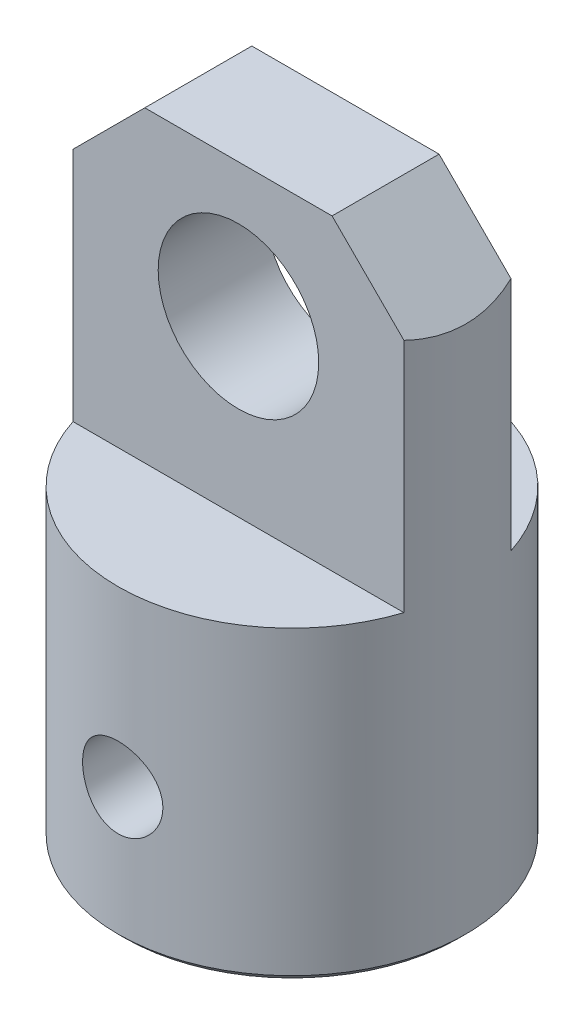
ISO-10303-21;
HEADER;
FILE_DESCRIPTION(('STEP AP214'),'2;1');
FILE_NAME('part.step','',(''),(''),'','','');
FILE_SCHEMA(('AUTOMOTIVE_DESIGN { 1 0 10303 214 1 1 1 1 }'));
ENDSEC;
DATA;
#1=APPLICATION_CONTEXT('core data for automotive mechanical design processes');
#2=APPLICATION_PROTOCOL_DEFINITION('international standard','automotive_design',2000,#1);
#3=PRODUCT_CONTEXT('',#1,'mechanical');
#4=PRODUCT('Part','Part','',(#3));
#5=PRODUCT_RELATED_PRODUCT_CATEGORY('part','',(#4));
#6=PRODUCT_DEFINITION_FORMATION('','',#4);
#7=PRODUCT_DEFINITION_CONTEXT('part definition',#1,'design');
#8=PRODUCT_DEFINITION('design','',#6,#7);
#9=PRODUCT_DEFINITION_SHAPE('','',#8);
#10=(LENGTH_UNIT() NAMED_UNIT(*) SI_UNIT(.MILLI.,.METRE.));
#11=(NAMED_UNIT(*) PLANE_ANGLE_UNIT() SI_UNIT($,.RADIAN.));
#12=(NAMED_UNIT(*) SI_UNIT($,.STERADIAN.) SOLID_ANGLE_UNIT());
#13=UNCERTAINTY_MEASURE_WITH_UNIT(LENGTH_MEASURE(1.E-05),#10,'distance_accuracy_value','');
#14=(GEOMETRIC_REPRESENTATION_CONTEXT(3) GLOBAL_UNCERTAINTY_ASSIGNED_CONTEXT((#13)) GLOBAL_UNIT_ASSIGNED_CONTEXT((#10,
#11,#12)) REPRESENTATION_CONTEXT('',''));
#15=CARTESIAN_POINT('',(0.,0.,0.));
#16=DIRECTION('',(0.,0.,1.));
#17=DIRECTION('',(1.,0.,0.));
#18=AXIS2_PLACEMENT_3D('',#15,#16,#17);
#19=CARTESIAN_POINT('',(0.,46.,0.));
#20=DIRECTION('',(0.,-1.,0.));
#21=DIRECTION('',(0.,0.,-1.));
#22=AXIS2_PLACEMENT_3D('',#19,#20,#21);
#23=CYLINDRICAL_SURFACE('',#22,13.);
#24=CARTESIAN_POINT('',(2.99999999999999,10.,12.6491106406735));
#25=CARTESIAN_POINT('',(2.9999946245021,9.83391407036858,12.6491139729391));
#26=CARTESIAN_POINT('',(2.98616079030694,9.66776551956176,12.6524174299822));
#27=CARTESIAN_POINT('',(2.93126165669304,9.34021047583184,12.6652465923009));
#28=CARTESIAN_POINT('',(2.89017810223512,9.17880723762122,12.674776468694));
#29=CARTESIAN_POINT('',(2.78215616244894,8.8655281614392,12.6989229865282));
#30=CARTESIAN_POINT('',(2.71524798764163,8.71364143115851,12.713533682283));
#31=CARTESIAN_POINT('',(2.55756476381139,8.42324039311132,12.7461883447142));
#32=CARTESIAN_POINT('',(2.46678964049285,8.2847261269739,12.764232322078));
#33=CARTESIAN_POINT('',(2.26213062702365,8.02239954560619,12.8020993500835));
#34=CARTESIAN_POINT('',(2.14788224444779,7.89887513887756,12.8219473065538));
#35=CARTESIAN_POINT('',(1.90030604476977,7.67256171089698,12.860968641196));
#36=CARTESIAN_POINT('',(1.76697663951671,7.56977441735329,12.8801419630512));
#37=CARTESIAN_POINT('',(1.48307705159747,7.38669955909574,12.915926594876));
#38=CARTESIAN_POINT('',(1.33232237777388,7.30669112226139,12.9325050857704));
#39=CARTESIAN_POINT('',(1.01905965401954,7.17325429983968,12.9609497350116));
#40=CARTESIAN_POINT('',(0.856553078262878,7.11982258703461,12.9728164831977));
#41=CARTESIAN_POINT('',(0.527396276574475,7.04196767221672,12.990324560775));
#42=CARTESIAN_POINT('',(0.360867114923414,7.01705655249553,12.9960704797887));
#43=CARTESIAN_POINT('',(0.0259008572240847,6.99542221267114,13.0010526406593));
#44=CARTESIAN_POINT('',(-0.142535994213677,6.99869541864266,13.000289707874));
#45=CARTESIAN_POINT('',(-0.47316524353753,7.03297803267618,12.9924192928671));
#46=CARTESIAN_POINT('',(-0.635415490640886,7.06346126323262,12.9854321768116));
#47=CARTESIAN_POINT('',(-0.952433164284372,7.15045745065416,12.9660366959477));
#48=CARTESIAN_POINT('',(-1.10720022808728,7.20697166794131,12.9536280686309));
#49=CARTESIAN_POINT('',(-1.40629128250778,7.34487615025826,12.9245937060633));
#50=CARTESIAN_POINT('',(-1.55052208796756,7.42646131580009,12.9079351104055));
#51=CARTESIAN_POINT('',(-1.82343497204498,7.61204558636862,12.8722203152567));
#52=CARTESIAN_POINT('',(-1.95211470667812,7.71604806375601,12.8531637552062));
#53=CARTESIAN_POINT('',(-2.19340588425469,7.94636350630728,12.8142215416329));
#54=CARTESIAN_POINT('',(-2.30557688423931,8.0731368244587,12.7943269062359));
#55=CARTESIAN_POINT('',(-2.50715545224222,8.34390246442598,12.7563601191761));
#56=CARTESIAN_POINT('',(-2.59656225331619,8.48789536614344,12.7382880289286));
#57=CARTESIAN_POINT('',(-2.75030147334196,8.78978051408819,12.7059853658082));
#58=CARTESIAN_POINT('',(-2.81454229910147,8.94772101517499,12.6917688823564));
#59=CARTESIAN_POINT('',(-2.91543265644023,9.27256355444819,12.6689761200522));
#60=CARTESIAN_POINT('',(-2.95208711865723,9.4394639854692,12.6603988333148));
#61=CARTESIAN_POINT('',(-2.99606364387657,9.7734418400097,12.6500634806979));
#62=CARTESIAN_POINT('',(-3.00403068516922,9.94042979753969,12.6481554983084));
#63=CARTESIAN_POINT('',(-2.99215969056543,10.2733480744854,12.6509690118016));
#64=CARTESIAN_POINT('',(-2.97232380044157,10.4392784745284,12.6556899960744));
#65=CARTESIAN_POINT('',(-2.90597189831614,10.7630710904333,12.6710871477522));
#66=CARTESIAN_POINT('',(-2.85981855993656,10.9210118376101,12.6816823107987));
#67=CARTESIAN_POINT('',(-2.74253802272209,11.2269175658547,12.7075595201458));
#68=CARTESIAN_POINT('',(-2.67140821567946,11.3748815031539,12.7228420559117));
#69=CARTESIAN_POINT('',(-2.50479935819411,11.6594030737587,12.7566963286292));
#70=CARTESIAN_POINT('',(-2.40892731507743,11.7957243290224,12.775319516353));
#71=CARTESIAN_POINT('',(-2.19606317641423,12.0505807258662,12.8136246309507));
#72=CARTESIAN_POINT('',(-2.07906814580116,12.1691133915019,12.833306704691));
#73=CARTESIAN_POINT('',(-1.82434490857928,12.387571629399,12.8720112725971));
#74=CARTESIAN_POINT('',(-1.68623348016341,12.4870550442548,12.8910112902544));
#75=CARTESIAN_POINT('',(-1.39488634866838,12.6614108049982,12.9257797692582));
#76=CARTESIAN_POINT('',(-1.24165139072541,12.7362843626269,12.9415483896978));
#77=CARTESIAN_POINT('',(-0.925410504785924,12.8586994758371,12.9679835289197));
#78=CARTESIAN_POINT('',(-0.762478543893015,12.90642440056,12.9786841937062));
#79=CARTESIAN_POINT('',(-0.430632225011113,12.9737530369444,12.9939261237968));
#80=CARTESIAN_POINT('',(-0.261718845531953,12.9933613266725,12.99846839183));
#81=CARTESIAN_POINT('',(0.0731147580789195,13.0036749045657,13.0008478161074));
#82=CARTESIAN_POINT('',(0.239013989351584,12.995037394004,12.9988374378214));
#83=CARTESIAN_POINT('',(0.566928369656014,12.9505876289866,12.9886683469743));
#84=CARTESIAN_POINT('',(0.728943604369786,12.9147759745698,12.980509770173));
#85=CARTESIAN_POINT('',(1.04391562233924,12.8173240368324,12.9589769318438));
#86=CARTESIAN_POINT('',(1.19690572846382,12.7557865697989,12.9456234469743));
#87=CARTESIAN_POINT('',(1.49047181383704,12.608726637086,12.9151190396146));
#88=CARTESIAN_POINT('',(1.63104644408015,12.5232015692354,12.8979677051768));
#89=CARTESIAN_POINT('',(1.89896480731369,12.3285024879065,12.8612836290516));
#90=CARTESIAN_POINT('',(2.0259711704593,12.2188721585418,12.8417086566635));
#91=CARTESIAN_POINT('',(2.2600083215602,11.9799824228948,12.8025963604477));
#92=CARTESIAN_POINT('',(2.36703420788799,11.8507182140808,12.7830590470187));
#93=CARTESIAN_POINT('',(2.5596581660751,11.5738560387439,12.7458991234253));
#94=CARTESIAN_POINT('',(2.64490430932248,11.426008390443,12.7283102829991));
#95=CARTESIAN_POINT('',(2.78920331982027,11.1177043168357,12.6974733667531));
#96=CARTESIAN_POINT('',(2.84827722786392,10.9572581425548,12.6842218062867));
#97=CARTESIAN_POINT('',(2.92864765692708,10.6640017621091,12.6658719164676));
#98=CARTESIAN_POINT('',(2.95535096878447,10.5327182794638,12.6596301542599));
#99=CARTESIAN_POINT('',(2.99102876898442,10.2676366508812,12.6512482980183));
#100=CARTESIAN_POINT('',(3.00000433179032,10.1338386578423,12.6491079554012));
#101=CARTESIAN_POINT('',(2.99999999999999,10.,12.6491106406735));
#102=B_SPLINE_CURVE_WITH_KNOTS('',3,(#24,#25,#26,#27,#28,#29,#30,#31,#32,#33,#34,#35,#36,#37,
#38,#39,#40,#41,#42,#43,#44,#45,#46,#47,#48,#49,#50,#51,#52,#53,#54,#55,#56,#57,#58,#59,#60,#61,
#62,#63,#64,#65,#66,#67,#68,#69,#70,#71,#72,#73,#74,#75,#76,#77,#78,#79,#80,#81,#82,#83,#84,#85,
#86,#87,#88,#89,#90,#91,#92,#93,#94,#95,#96,#97,#98,#99,#100,#101),.UNSPECIFIED.,.T.,.F.,(4,2,2,
2,2,2,2,2,2,2,2,2,2,2,2,2,2,2,2,2,2,2,2,2,2,2,2,2,2,2,2,2,2,2,2,2,2,2,4),(0.,0.497766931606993,
0.995867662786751,1.4933874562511,1.99090879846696,2.49683528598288,3.00280390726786,
3.51472913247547,4.02659025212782,4.52955730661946,5.03246058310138,5.52584465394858,
6.01925261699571,6.5165977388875,7.01401773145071,7.52294169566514,8.03188280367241,
8.54265939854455,9.05334467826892,9.55247393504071,10.0515646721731,10.5439382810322,
11.0363633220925,11.5371508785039,12.0380080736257,12.549364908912,13.0606965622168,
13.5685322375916,14.0762852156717,14.5723090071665,15.068321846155,15.5623709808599,
16.0564737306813,16.5608887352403,17.0654273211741,17.5776655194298,18.0894911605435,
18.4906358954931,18.8917563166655),.UNSPECIFIED.);
#103=CARTESIAN_POINT('',(0.,13.,13.));
#104=VERTEX_POINT('',#103);
#105=CARTESIAN_POINT('',(0.,7.,13.));
#106=VERTEX_POINT('',#105);
#107=EDGE_CURVE('E438',#104,#106,#102,.T.);
#108=ORIENTED_EDGE('',*,*,#107,.T.);
#109=EDGE_CURVE('E374',#106,#104,#102,.T.);
#110=ORIENTED_EDGE('',*,*,#109,.T.);
#111=EDGE_LOOP('',(#108,#110));
#112=FACE_BOUND('',#111,.T.);
#113=CARTESIAN_POINT('',(0.,13.,-13.));
#114=CARTESIAN_POINT('',(-0.166152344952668,12.9999946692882,-12.9999969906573));
#115=CARTESIAN_POINT('',(-0.332367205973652,12.9861501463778,-12.9967824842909));
#116=CARTESIAN_POINT('',(-0.660059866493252,12.9312047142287,-12.9842700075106));
#117=CARTESIAN_POINT('',(-0.821534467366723,12.8900858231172,-12.9749680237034));
#118=CARTESIAN_POINT('',(-1.13496480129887,12.7819606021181,-12.9513142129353));
#119=CARTESIAN_POINT('',(-1.28693082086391,12.7149828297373,-12.936967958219));
#120=CARTESIAN_POINT('',(-1.577465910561,12.5571354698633,-12.904766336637));
#121=CARTESIAN_POINT('',(-1.71603502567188,12.4662659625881,-12.8869109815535));
#122=CARTESIAN_POINT('',(-1.97830470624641,12.2615094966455,-12.8492864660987));
#123=CARTESIAN_POINT('',(-2.10173358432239,12.1472792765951,-12.8294913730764));
#124=CARTESIAN_POINT('',(-2.32786120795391,11.8997801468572,-12.7903971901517));
#125=CARTESIAN_POINT('',(-2.43055793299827,11.7665093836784,-12.7710981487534));
#126=CARTESIAN_POINT('',(-2.61353391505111,11.4826661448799,-12.7349234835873));
#127=CARTESIAN_POINT('',(-2.69351850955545,11.3318991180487,-12.7180809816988));
#128=CARTESIAN_POINT('',(-2.82690790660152,11.0186098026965,-12.6891009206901));
#129=CARTESIAN_POINT('',(-2.88031627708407,10.8560890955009,-12.6769627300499));
#130=CARTESIAN_POINT('',(-2.95812848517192,10.5268683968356,-12.6590306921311));
#131=CARTESIAN_POINT('',(-2.98301618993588,10.3602886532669,-12.6531311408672));
#132=CARTESIAN_POINT('',(-3.00458614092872,10.0252218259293,-12.6480272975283));
#133=CARTESIAN_POINT('',(-3.0012722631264,9.85673500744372,-12.6488220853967));
#134=CARTESIAN_POINT('',(-2.96692126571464,9.52627438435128,-12.6569216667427));
#135=CARTESIAN_POINT('',(-2.93645150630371,9.36423783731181,-12.6640932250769));
#136=CARTESIAN_POINT('',(-2.84955482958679,9.04764041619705,-12.683927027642));
#137=CARTESIAN_POINT('',(-2.79312630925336,8.89308000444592,-12.6965896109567));
#138=CARTESIAN_POINT('',(-2.65540698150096,8.59425465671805,-12.726106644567));
#139=CARTESIAN_POINT('',(-2.57390258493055,8.45009183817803,-12.7429968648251));
#140=CARTESIAN_POINT('',(-2.38849497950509,8.17728152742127,-12.7790447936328));
#141=CARTESIAN_POINT('',(-2.2845883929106,8.04863637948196,-12.7982028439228));
#142=CARTESIAN_POINT('',(-2.05434642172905,7.80725209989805,-12.8371955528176));
#143=CARTESIAN_POINT('',(-1.9275299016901,7.69497222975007,-12.8570353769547));
#144=CARTESIAN_POINT('',(-1.6566372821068,7.49319385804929,-12.8947363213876));
#145=CARTESIAN_POINT('',(-1.51256079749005,7.40369586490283,-12.91259739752));
#146=CARTESIAN_POINT('',(-1.21064255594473,7.24988817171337,-12.94439708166));
#147=CARTESIAN_POINT('',(-1.05276628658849,7.18564396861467,-12.9583254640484));
#148=CARTESIAN_POINT('',(-0.728064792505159,7.0847277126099,-12.980615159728));
#149=CARTESIAN_POINT('',(-0.561241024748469,7.04805118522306,-12.9889773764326));
#150=CARTESIAN_POINT('',(-0.227314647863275,7.00399169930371,-12.999062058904));
#151=CARTESIAN_POINT('',(-0.0602988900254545,6.99598212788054,-13.0009265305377));
#152=CARTESIAN_POINT('',(0.272684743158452,7.00777802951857,-12.9982059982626));
#153=CARTESIAN_POINT('',(0.438652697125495,7.027581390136,-12.9936214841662));
#154=CARTESIAN_POINT('',(0.762715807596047,7.09392239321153,-12.9786082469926));
#155=CARTESIAN_POINT('',(0.920882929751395,7.14012648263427,-12.968252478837));
#156=CARTESIAN_POINT('',(1.22721924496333,7.25758317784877,-12.9428582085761));
#157=CARTESIAN_POINT('',(1.3753875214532,7.32883807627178,-12.9278192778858));
#158=CARTESIAN_POINT('',(1.66007523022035,7.49564528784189,-12.8943799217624));
#159=CARTESIAN_POINT('',(1.79637682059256,7.59155938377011,-12.8759307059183));
#160=CARTESIAN_POINT('',(2.05117436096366,7.80449123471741,-12.8378078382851));
#161=CARTESIAN_POINT('',(2.16966771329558,7.92151206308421,-12.8181340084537));
#162=CARTESIAN_POINT('',(2.38800205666,8.17622477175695,-12.7792809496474));
#163=CARTESIAN_POINT('',(2.48740687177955,8.31429392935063,-12.7601203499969));
#164=CARTESIAN_POINT('',(2.66162470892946,8.60553176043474,-12.7249237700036));
#165=CARTESIAN_POINT('',(2.73643882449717,8.75869976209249,-12.7088876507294));
#166=CARTESIAN_POINT('',(2.85882133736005,9.07495197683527,-12.6819190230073));
#167=CARTESIAN_POINT('',(2.90654808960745,9.23797225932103,-12.6709569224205));
#168=CARTESIAN_POINT('',(2.97385061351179,9.57000798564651,-12.6553320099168));
#169=CARTESIAN_POINT('',(2.99343148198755,9.73902233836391,-12.6506680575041));
#170=CARTESIAN_POINT('',(3.00365072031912,10.0738364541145,-12.6482450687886));
#171=CARTESIAN_POINT('',(2.99498255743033,10.2396142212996,-12.6503205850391));
#172=CARTESIAN_POINT('',(2.9505137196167,10.5672773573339,-12.6607654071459));
#173=CARTESIAN_POINT('',(2.91471344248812,10.7291627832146,-12.6691346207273));
#174=CARTESIAN_POINT('',(2.8173484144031,11.0438198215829,-12.6911387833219));
#175=CARTESIAN_POINT('',(2.7558954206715,11.1966277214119,-12.7047508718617));
#176=CARTESIAN_POINT('',(2.60906164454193,11.4898636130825,-12.7357136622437));
#177=CARTESIAN_POINT('',(2.52367805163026,11.6302901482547,-12.7530648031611));
#178=CARTESIAN_POINT('',(2.32915359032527,11.8981710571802,-12.7900365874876));
#179=CARTESIAN_POINT('',(2.21952324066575,12.0252642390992,-12.8096993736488));
#180=CARTESIAN_POINT('',(1.98059542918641,12.2594764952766,-12.8488080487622));
#181=CARTESIAN_POINT('',(1.85129339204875,12.3665909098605,-12.8682538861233));
#182=CARTESIAN_POINT('',(1.5743838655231,12.5593345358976,-12.9050799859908));
#183=CARTESIAN_POINT('',(1.42653373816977,12.6446222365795,-12.9224254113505));
#184=CARTESIAN_POINT('',(1.11821928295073,12.7889982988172,-12.9527409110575));
#185=CARTESIAN_POINT('',(0.957765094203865,12.8481074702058,-12.9657144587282));
#186=CARTESIAN_POINT('',(0.664420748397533,12.9285569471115,-12.9836544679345));
#187=CARTESIAN_POINT('',(0.533052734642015,12.955294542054,-12.989744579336));
#188=CARTESIAN_POINT('',(0.26780326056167,12.9910177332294,-12.9979184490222));
#189=CARTESIAN_POINT('',(0.133921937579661,13.0000042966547,-13.0000024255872));
#190=CARTESIAN_POINT('',(0.,13.,-13.));
#191=B_SPLINE_CURVE_WITH_KNOTS('',3,(#113,#114,#115,#116,#117,#118,#119,#120,#121,#122,#123,
#124,#125,#126,#127,#128,#129,#130,#131,#132,#133,#134,#135,#136,#137,#138,#139,#140,#141,#142,
#143,#144,#145,#146,#147,#148,#149,#150,#151,#152,#153,#154,#155,#156,#157,#158,#159,#160,#161,
#162,#163,#164,#165,#166,#167,#168,#169,#170,#171,#172,#173,#174,#175,#176,#177,#178,#179,#180,
#181,#182,#183,#184,#185,#186,#187,#188,#189,#190),.UNSPECIFIED.,.T.,.F.,(4,2,2,2,2,2,2,2,2,2,2,
2,2,2,2,2,2,2,2,2,2,2,2,2,2,2,2,2,2,2,2,2,2,2,2,2,2,2,4),(0.,0.497966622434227,
0.996261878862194,1.49400840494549,1.9917532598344,2.49741860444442,3.00313320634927,
3.5151368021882,4.0270716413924,4.53018632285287,5.03323185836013,5.52600755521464,
6.01881368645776,6.51593939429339,7.01314010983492,7.52235052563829,8.03157230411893,
8.54210619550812,9.05255720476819,9.55178002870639,10.0509649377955,10.5439782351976,
11.0370366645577,11.5377886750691,12.0386136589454,12.5497908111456,13.0609452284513,
13.5690797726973,14.0771222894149,14.5727880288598,15.0684465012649,15.5619677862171,
16.0555470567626,16.5601864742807,17.0649434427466,17.5771721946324,18.0889930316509,
18.490385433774,18.8917559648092),.UNSPECIFIED.);
#192=CARTESIAN_POINT('',(0.,7.,-13.));
#193=VERTEX_POINT('',#192);
#194=CARTESIAN_POINT('',(0.,13.,-13.));
#195=VERTEX_POINT('',#194);
#196=EDGE_CURVE('E425',#193,#195,#191,.T.);
#197=ORIENTED_EDGE('',*,*,#196,.T.);
#198=EDGE_CURVE('E381',#195,#193,#191,.T.);
#199=ORIENTED_EDGE('',*,*,#198,.T.);
#200=EDGE_LOOP('',(#197,#199));
#201=FACE_BOUND('',#200,.T.);
#202=CARTESIAN_POINT('',(0.,0.5,0.));
#203=DIRECTION('',(0.,1.,0.));
#204=DIRECTION('',(0.,0.,1.));
#205=AXIS2_PLACEMENT_3D('',#202,#203,#204);
#206=CIRCLE('',#205,13.);
#207=CARTESIAN_POINT('',(0.,0.5,13.));
#208=VERTEX_POINT('',#207);
#209=EDGE_CURVE('E367',#208,#208,#206,.T.);
#210=ORIENTED_EDGE('',*,*,#209,.T.);
#211=EDGE_LOOP('',(#210));
#212=FACE_BOUND('',#211,.T.);
#213=DIRECTION('',(0.,-1.,0.));
#214=VECTOR('',#213,1.);
#215=CARTESIAN_POINT('',(-12.369316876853,46.,4.));
#216=LINE('',#215,#214);
#217=CARTESIAN_POINT('',(-12.369316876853,40.630683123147,4.));
#218=VERTEX_POINT('',#217);
#219=CARTESIAN_POINT('',(-12.369316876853,23.,4.));
#220=VERTEX_POINT('',#219);
#221=EDGE_CURVE('E527',#218,#220,#216,.T.);
#222=ORIENTED_EDGE('',*,*,#221,.F.);
#223=CARTESIAN_POINT('',(0.,53.,0.));
#224=DIRECTION('',(-0.707106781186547,0.707106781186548,0.));
#225=DIRECTION('',(-0.707106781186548,-0.707106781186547,0.));
#226=AXIS2_PLACEMENT_3D('',#223,#224,#225);
#227=ELLIPSE('',#226,18.3847763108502,13.);
#228=CARTESIAN_POINT('',(-12.369316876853,40.630683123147,-4.));
#229=VERTEX_POINT('',#228);
#230=EDGE_CURVE('E554',#229,#218,#227,.T.);
#231=ORIENTED_EDGE('',*,*,#230,.F.);
#232=DIRECTION('',(0.,-1.,0.));
#233=VECTOR('',#232,1.);
#234=CARTESIAN_POINT('',(-12.369316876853,46.,-4.));
#235=LINE('',#234,#233);
#236=CARTESIAN_POINT('',(-12.369316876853,23.,-4.));
#237=VERTEX_POINT('',#236);
#238=EDGE_CURVE('E539',#237,#229,#235,.F.);
#239=ORIENTED_EDGE('',*,*,#238,.F.);
#240=CARTESIAN_POINT('',(0.,23.,0.));
#241=DIRECTION('',(0.,1.,0.));
#242=DIRECTION('',(0.,0.,1.));
#243=AXIS2_PLACEMENT_3D('',#240,#241,#242);
#244=CIRCLE('',#243,13.);
#245=CARTESIAN_POINT('',(12.369316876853,23.,-4.));
#246=VERTEX_POINT('',#245);
#247=EDGE_CURVE('E493',#246,#237,#244,.T.);
#248=ORIENTED_EDGE('',*,*,#247,.F.);
#249=DIRECTION('',(0.,-1.,0.));
#250=VECTOR('',#249,1.);
#251=CARTESIAN_POINT('',(12.369316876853,46.,-4.));
#252=LINE('',#251,#250);
#253=CARTESIAN_POINT('',(12.369316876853,40.630683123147,-4.));
#254=VERTEX_POINT('',#253);
#255=EDGE_CURVE('E537',#254,#246,#252,.T.);
#256=ORIENTED_EDGE('',*,*,#255,.F.);
#257=CARTESIAN_POINT('',(0.,53.,0.));
#258=DIRECTION('',(-0.707106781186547,-0.707106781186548,0.));
#259=DIRECTION('',(0.707106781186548,-0.707106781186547,0.));
#260=AXIS2_PLACEMENT_3D('',#257,#258,#259);
#261=ELLIPSE('',#260,18.3847763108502,13.);
#262=CARTESIAN_POINT('',(12.369316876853,40.630683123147,4.));
#263=VERTEX_POINT('',#262);
#264=EDGE_CURVE('E548',#254,#263,#261,.T.);
#265=ORIENTED_EDGE('',*,*,#264,.T.);
#266=DIRECTION('',(0.,-1.,0.));
#267=VECTOR('',#266,1.);
#268=CARTESIAN_POINT('',(12.369316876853,46.,4.));
#269=LINE('',#268,#267);
#270=CARTESIAN_POINT('',(12.369316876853,23.,4.));
#271=VERTEX_POINT('',#270);
#272=EDGE_CURVE('E531',#271,#263,#269,.F.);
#273=ORIENTED_EDGE('',*,*,#272,.F.);
#274=CARTESIAN_POINT('',(0.,23.,0.));
#275=DIRECTION('',(0.,1.,0.));
#276=DIRECTION('',(0.,0.,1.));
#277=AXIS2_PLACEMENT_3D('',#274,#275,#276);
#278=CIRCLE('',#277,13.);
#279=EDGE_CURVE('E494',#220,#271,#278,.T.);
#280=ORIENTED_EDGE('',*,*,#279,.F.);
#281=EDGE_LOOP('',(#222,#231,#239,#248,#256,#265,#273,#280));
#282=FACE_BOUND('',#281,.T.);
#283=ADVANCED_FACE('F353',(#112,#201,#212,#282),#23,.T.);
#284=CARTESIAN_POINT('',(0.,46.,0.));
#285=DIRECTION('',(0.,1.,0.));
#286=DIRECTION('',(0.,0.,1.));
#287=AXIS2_PLACEMENT_3D('',#284,#285,#286);
#288=PLANE('',#287);
#289=DIRECTION('',(-1.,0.,0.));
#290=VECTOR('',#289,1.);
#291=CARTESIAN_POINT('',(0.,46.,-4.));
#292=LINE('',#291,#290);
#293=CARTESIAN_POINT('',(7.,46.,-4.));
#294=VERTEX_POINT('',#293);
#295=CARTESIAN_POINT('',(-7.,46.,-4.));
#296=VERTEX_POINT('',#295);
#297=EDGE_CURVE('E484',#294,#296,#292,.T.);
#298=ORIENTED_EDGE('',*,*,#297,.T.);
#299=DIRECTION('',(0.,0.,-1.));
#300=VECTOR('',#299,1.);
#301=CARTESIAN_POINT('',(-7.,46.,88.8621593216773));
#302=LINE('',#301,#300);
#303=CARTESIAN_POINT('',(-7.,46.,4.));
#304=VERTEX_POINT('',#303);
#305=EDGE_CURVE('E485',#304,#296,#302,.T.);
#306=ORIENTED_EDGE('',*,*,#305,.F.);
#307=DIRECTION('',(1.,0.,0.));
#308=VECTOR('',#307,1.);
#309=CARTESIAN_POINT('',(0.,46.,4.));
#310=LINE('',#309,#308);
#311=CARTESIAN_POINT('',(7.,46.,4.));
#312=VERTEX_POINT('',#311);
#313=EDGE_CURVE('E498',#304,#312,#310,.T.);
#314=ORIENTED_EDGE('',*,*,#313,.T.);
#315=DIRECTION('',(0.,0.,-1.));
#316=VECTOR('',#315,1.);
#317=CARTESIAN_POINT('',(7.,46.,88.8621593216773));
#318=LINE('',#317,#316);
#319=EDGE_CURVE('E488',#312,#294,#318,.T.);
#320=ORIENTED_EDGE('',*,*,#319,.T.);
#321=EDGE_LOOP('',(#298,#306,#314,#320));
#322=FACE_BOUND('',#321,.T.);
#323=ADVANCED_FACE('F469',(#322),#288,.T.);
#324=CARTESIAN_POINT('',(13.,23.,4.));
#325=DIRECTION('',(0.,0.,1.));
#326=DIRECTION('',(1.,0.,0.));
#327=AXIS2_PLACEMENT_3D('',#324,#325,#326);
#328=PLANE('',#327);
#329=CARTESIAN_POINT('',(0.,36.,4.));
#330=DIRECTION('',(0.,0.,1.));
#331=DIRECTION('',(1.,0.,0.));
#332=AXIS2_PLACEMENT_3D('',#329,#330,#331);
#333=CIRCLE('',#332,6.);
#334=CARTESIAN_POINT('',(6.,36.,4.));
#335=VERTEX_POINT('',#334);
#336=EDGE_CURVE('E432',#335,#335,#333,.T.);
#337=ORIENTED_EDGE('',*,*,#336,.F.);
#338=EDGE_LOOP('',(#337));
#339=FACE_BOUND('',#338,.T.);
#340=ORIENTED_EDGE('',*,*,#313,.F.);
#341=DIRECTION('',(-0.707106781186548,-0.707106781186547,0.));
#342=VECTOR('',#341,1.);
#343=CARTESIAN_POINT('',(-8.5,44.5,4.));
#344=LINE('',#343,#342);
#345=EDGE_CURVE('E551',#304,#218,#344,.T.);
#346=ORIENTED_EDGE('',*,*,#345,.T.);
#347=ORIENTED_EDGE('',*,*,#221,.T.);
#348=DIRECTION('',(1.,0.,0.));
#349=VECTOR('',#348,1.);
#350=CARTESIAN_POINT('',(13.,23.,4.));
#351=LINE('',#350,#349);
#352=EDGE_CURVE('E534',#220,#271,#351,.T.);
#353=ORIENTED_EDGE('',*,*,#352,.T.);
#354=ORIENTED_EDGE('',*,*,#272,.T.);
#355=DIRECTION('',(0.707106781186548,-0.707106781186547,0.));
#356=VECTOR('',#355,1.);
#357=CARTESIAN_POINT('',(21.5,31.5,4.));
#358=LINE('',#357,#356);
#359=EDGE_CURVE('E545',#312,#263,#358,.T.);
#360=ORIENTED_EDGE('',*,*,#359,.F.);
#361=EDGE_LOOP('',(#340,#346,#347,#353,#354,#360));
#362=FACE_BOUND('',#361,.T.);
#363=ADVANCED_FACE('F471',(#339,#362),#328,.T.);
#364=CARTESIAN_POINT('',(13.,46.,-4.));
#365=DIRECTION('',(0.,0.,-1.));
#366=DIRECTION('',(-1.,0.,0.));
#367=AXIS2_PLACEMENT_3D('',#364,#365,#366);
#368=PLANE('',#367);
#369=CARTESIAN_POINT('',(0.,36.,-4.));
#370=DIRECTION('',(0.,0.,-1.));
#371=DIRECTION('',(-1.,0.,0.));
#372=AXIS2_PLACEMENT_3D('',#369,#370,#371);
#373=CIRCLE('',#372,6.);
#374=CARTESIAN_POINT('',(-6.,36.,-4.));
#375=VERTEX_POINT('',#374);
#376=EDGE_CURVE('E430',#375,#375,#373,.T.);
#377=ORIENTED_EDGE('',*,*,#376,.F.);
#378=EDGE_LOOP('',(#377));
#379=FACE_BOUND('',#378,.T.);
#380=ORIENTED_EDGE('',*,*,#238,.T.);
#381=DIRECTION('',(0.707106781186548,0.707106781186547,0.));
#382=VECTOR('',#381,1.);
#383=CARTESIAN_POINT('',(3.00000000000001,56.,-4.));
#384=LINE('',#383,#382);
#385=EDGE_CURVE('E503',#229,#296,#384,.T.);
#386=ORIENTED_EDGE('',*,*,#385,.T.);
#387=ORIENTED_EDGE('',*,*,#297,.F.);
#388=DIRECTION('',(-0.707106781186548,0.707106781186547,0.));
#389=VECTOR('',#388,1.);
#390=CARTESIAN_POINT('',(10.,43.,-4.));
#391=LINE('',#390,#389);
#392=EDGE_CURVE('E496',#254,#294,#391,.T.);
#393=ORIENTED_EDGE('',*,*,#392,.F.);
#394=ORIENTED_EDGE('',*,*,#255,.T.);
#395=DIRECTION('',(1.,0.,0.));
#396=VECTOR('',#395,1.);
#397=CARTESIAN_POINT('',(13.,23.,-4.));
#398=LINE('',#397,#396);
#399=EDGE_CURVE('E542',#237,#246,#398,.T.);
#400=ORIENTED_EDGE('',*,*,#399,.F.);
#401=EDGE_LOOP('',(#380,#386,#387,#393,#394,#400));
#402=FACE_BOUND('',#401,.T.);
#403=ADVANCED_FACE('F467',(#379,#402),#368,.T.);
#404=CARTESIAN_POINT('',(0.,0.,0.));
#405=DIRECTION('',(0.,1.,0.));
#406=DIRECTION('',(0.,0.,1.));
#407=AXIS2_PLACEMENT_3D('',#404,#405,#406);
#408=PLANE('',#407);
#409=CARTESIAN_POINT('',(0.,0.,0.));
#410=DIRECTION('',(0.,1.,0.));
#411=DIRECTION('',(0.,0.,1.));
#412=AXIS2_PLACEMENT_3D('',#409,#410,#411);
#413=CIRCLE('',#412,12.5);
#414=CARTESIAN_POINT('',(0.,0.,12.5));
#415=VERTEX_POINT('',#414);
#416=EDGE_CURVE('E12',#415,#415,#413,.F.);
#417=ORIENTED_EDGE('',*,*,#416,.T.);
#418=EDGE_LOOP('',(#417));
#419=FACE_BOUND('',#418,.T.);
#420=CARTESIAN_POINT('',(0.,0.,0.));
#421=DIRECTION('',(0.,-1.,0.));
#422=DIRECTION('',(0.,0.,-1.));
#423=AXIS2_PLACEMENT_3D('',#420,#421,#422);
#424=CIRCLE('',#423,8.);
#425=CARTESIAN_POINT('',(0.,0.,-8.));
#426=VERTEX_POINT('',#425);
#427=EDGE_CURVE('E522',#426,#426,#424,.T.);
#428=ORIENTED_EDGE('',*,*,#427,.F.);
#429=EDGE_LOOP('',(#428));
#430=FACE_BOUND('',#429,.T.);
#431=ADVANCED_FACE('F462',(#419,#430),#408,.F.);
#432=CARTESIAN_POINT('',(0.,0.,0.));
#433=DIRECTION('',(0.,-1.,0.));
#434=DIRECTION('',(0.,0.,-1.));
#435=AXIS2_PLACEMENT_3D('',#432,#433,#434);
#436=CYLINDRICAL_SURFACE('',#435,8.);
#437=CARTESIAN_POINT('',(0.,13.,-8.));
#438=CARTESIAN_POINT('',(0.162470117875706,13.0000058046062,-8.00000434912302));
#439=CARTESIAN_POINT('',(0.324900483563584,12.9867604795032,-7.99500758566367));
#440=CARTESIAN_POINT('',(0.64490690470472,12.9343436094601,-7.97557392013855));
#441=CARTESIAN_POINT('',(0.80248365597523,12.8951757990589,-7.96113837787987));
#442=CARTESIAN_POINT('',(1.10812156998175,12.7924939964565,-7.92437664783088));
#443=CARTESIAN_POINT('',(1.25620044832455,12.7290269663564,-7.90206568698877));
#444=CARTESIAN_POINT('',(1.5395986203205,12.5797871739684,-7.85177535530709));
#445=CARTESIAN_POINT('',(1.67491447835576,12.4940084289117,-7.82379446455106));
#446=CARTESIAN_POINT('',(1.93469283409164,12.2987749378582,-7.76372493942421));
#447=CARTESIAN_POINT('',(2.05854146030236,12.1885394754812,-7.73152005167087));
#448=CARTESIAN_POINT('',(2.28648842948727,11.9491791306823,-7.66720441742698));
#449=CARTESIAN_POINT('',(2.39058072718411,11.8200484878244,-7.63509370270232));
#450=CARTESIAN_POINT('',(2.57996404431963,11.5405650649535,-7.5732494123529));
#451=CARTESIAN_POINT('',(2.66438786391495,11.3895912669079,-7.5436529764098));
#452=CARTESIAN_POINT('',(2.80637292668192,11.0743032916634,-7.49199720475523));
#453=CARTESIAN_POINT('',(2.86394489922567,10.9099944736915,-7.46993485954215));
#454=CARTESIAN_POINT('',(2.94816862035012,10.5797665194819,-7.43708825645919));
#455=CARTESIAN_POINT('',(2.97599186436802,10.414189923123,-7.42587848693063));
#456=CARTESIAN_POINT('',(3.00359113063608,10.0803676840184,-7.41476122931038));
#457=CARTESIAN_POINT('',(3.00337873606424,9.91212317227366,-7.41484907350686));
#458=CARTESIAN_POINT('',(2.97580859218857,9.58846094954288,-7.42595023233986));
#459=CARTESIAN_POINT('',(2.9500761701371,9.4328781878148,-7.43630937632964));
#460=CARTESIAN_POINT('',(2.87488335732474,9.12842569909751,-7.46569876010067));
#461=CARTESIAN_POINT('',(2.82541939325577,8.979556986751,-7.48473030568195));
#462=CARTESIAN_POINT('',(2.70327497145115,8.6894458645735,-7.52971404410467));
#463=CARTESIAN_POINT('',(2.63017297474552,8.54840102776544,-7.55579035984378));
#464=CARTESIAN_POINT('',(2.46312147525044,8.28010852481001,-7.61188420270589));
#465=CARTESIAN_POINT('',(2.36916477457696,8.15286564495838,-7.64190308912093));
#466=CARTESIAN_POINT('',(2.15563561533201,7.90679267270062,-7.70496077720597));
#467=CARTESIAN_POINT('',(2.03476597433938,7.78910271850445,-7.73806694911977));
#468=CARTESIAN_POINT('',(1.77462518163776,7.57532406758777,-7.80183456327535));
#469=CARTESIAN_POINT('',(1.63535120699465,7.47923869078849,-7.83249562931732));
#470=CARTESIAN_POINT('',(1.33944687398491,7.31013920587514,-7.88852789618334));
#471=CARTESIAN_POINT('',(1.18258142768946,7.23750483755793,-7.91380996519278));
#472=CARTESIAN_POINT('',(0.857673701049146,7.12003479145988,-7.95557436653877));
#473=CARTESIAN_POINT('',(0.68963642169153,7.07518676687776,-7.97206060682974));
#474=CARTESIAN_POINT('',(0.356750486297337,7.01675442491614,-7.99368886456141));
#475=CARTESIAN_POINT('',(0.192207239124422,7.00163478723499,-7.99938738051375));
#476=CARTESIAN_POINT('',(-0.137144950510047,6.99861787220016,-8.00051787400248));
#477=CARTESIAN_POINT('',(-0.301953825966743,7.01071455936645,-7.99595212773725));
#478=CARTESIAN_POINT('',(-0.620524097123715,7.06062008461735,-7.97743419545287));
#479=CARTESIAN_POINT('',(-0.774466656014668,7.09742308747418,-7.96384941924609));
#480=CARTESIAN_POINT('',(-1.07388350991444,7.19437214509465,-7.92902954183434));
#481=CARTESIAN_POINT('',(-1.21935670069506,7.25452123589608,-7.9077934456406));
#482=CARTESIAN_POINT('',(-1.50249553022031,7.39837282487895,-7.85899248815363));
#483=CARTESIAN_POINT('',(-1.63980616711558,7.48271545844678,-7.83126000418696));
#484=CARTESIAN_POINT('',(-1.89878542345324,7.67183620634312,-7.77253343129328));
#485=CARTESIAN_POINT('',(-2.02044824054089,7.77662186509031,-7.74153814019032));
#486=CARTESIAN_POINT('',(-2.25206159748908,8.01080824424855,-7.67746658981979));
#487=CARTESIAN_POINT('',(-2.36092308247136,8.1412843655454,-7.64437393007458));
#488=CARTESIAN_POINT('',(-2.55542100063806,8.41930276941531,-7.58157631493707));
#489=CARTESIAN_POINT('',(-2.64105534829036,8.566846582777,-7.55187166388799));
#490=CARTESIAN_POINT('',(-2.78675547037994,8.87603197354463,-7.49933659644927));
#491=CARTESIAN_POINT('',(-2.84671370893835,9.03772949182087,-7.47653520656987));
#492=CARTESIAN_POINT('',(-2.93815766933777,9.37001952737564,-7.4410806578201));
#493=CARTESIAN_POINT('',(-2.96966100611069,9.54060647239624,-7.42842122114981));
#494=CARTESIAN_POINT('',(-3.00172694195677,9.87403231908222,-7.41551789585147));
#495=CARTESIAN_POINT('',(-3.00414662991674,10.0366652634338,-7.41452889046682));
#496=CARTESIAN_POINT('',(-2.98273431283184,10.3598906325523,-7.42316825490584));
#497=CARTESIAN_POINT('',(-2.95890479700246,10.5204832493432,-7.43279561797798));
#498=CARTESIAN_POINT('',(-2.88711631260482,10.8300944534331,-7.46096283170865));
#499=CARTESIAN_POINT('',(-2.83991596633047,10.9793166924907,-7.47922170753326));
#500=CARTESIAN_POINT('',(-2.72339393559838,11.2678110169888,-7.52243096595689));
#501=CARTESIAN_POINT('',(-2.65406665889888,11.4070805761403,-7.54738303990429));
#502=CARTESIAN_POINT('',(-2.49104151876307,11.6796535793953,-7.60279447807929));
#503=CARTESIAN_POINT('',(-2.3962566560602,11.8122615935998,-7.63347396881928));
#504=CARTESIAN_POINT('',(-2.18668971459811,12.0602831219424,-7.69612493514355));
#505=CARTESIAN_POINT('',(-2.07190128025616,12.1756911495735,-7.7280968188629));
#506=CARTESIAN_POINT('',(-1.81816079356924,12.3924039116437,-7.79180849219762));
#507=CARTESIAN_POINT('',(-1.67823728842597,12.4926075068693,-7.82344209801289));
#508=CARTESIAN_POINT('',(-1.38242644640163,12.6680453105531,-7.88109028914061));
#509=CARTESIAN_POINT('',(-1.22653786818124,12.7432775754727,-7.90710443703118));
#510=CARTESIAN_POINT('',(-0.895998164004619,12.8687536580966,-7.9514858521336));
#511=CARTESIAN_POINT('',(-0.720826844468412,12.9177741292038,-7.96947314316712));
#512=CARTESIAN_POINT('',(-0.363751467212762,12.9833859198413,-7.99372484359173));
#513=CARTESIAN_POINT('',(-0.181850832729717,12.9999935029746,-7.99999513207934));
#514=CARTESIAN_POINT('',(0.,13.,-8.));
#515=B_SPLINE_CURVE_WITH_KNOTS('',3,(#437,#438,#439,#440,#441,#442,#443,#444,#445,#446,#447,
#448,#449,#450,#451,#452,#453,#454,#455,#456,#457,#458,#459,#460,#461,#462,#463,#464,#465,#466,
#467,#468,#469,#470,#471,#472,#473,#474,#475,#476,#477,#478,#479,#480,#481,#482,#483,#484,#485,
#486,#487,#488,#489,#490,#491,#492,#493,#494,#495,#496,#497,#498,#499,#500,#501,#502,#503,#504,
#505,#506,#507,#508,#509,#510,#511,#512,#513,#514),.UNSPECIFIED.,.T.,.F.,(4,2,2,2,2,2,2,2,2,2,2,
2,2,2,2,2,2,2,2,2,2,2,2,2,2,2,2,2,2,2,2,2,2,2,2,2,2,2,4),(0.,0.486739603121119,
0.973409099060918,1.45914273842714,1.94500675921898,2.4494723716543,2.95409209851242,
3.47793349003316,4.00156538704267,4.50371748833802,5.00566212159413,5.47756690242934,
5.94954276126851,6.43044816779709,6.91151981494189,7.42492306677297,7.93840515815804,
8.45982750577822,8.98101799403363,9.47450039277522,9.96787336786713,10.4422887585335,
10.9167658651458,11.4051844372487,11.8937836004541,12.4107303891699,12.9277235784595,
13.4468613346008,13.9656774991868,14.4511752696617,14.9366270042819,15.4072628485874,
15.8780177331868,16.3734494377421,16.8690388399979,17.3914465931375,17.9138949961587,
18.4589703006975,19.0037720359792),.UNSPECIFIED.);
#516=CARTESIAN_POINT('',(0.,13.,-8.));
#517=VERTEX_POINT('',#516);
#518=EDGE_CURVE('E357',#517,#517,#515,.T.);
#519=ORIENTED_EDGE('',*,*,#518,.T.);
#520=EDGE_LOOP('',(#519));
#521=FACE_BOUND('',#520,.T.);
#522=CARTESIAN_POINT('',(2.99999999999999,10.,7.41619848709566));
#523=CARTESIAN_POINT('',(3.00000608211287,10.1620149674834,7.41619281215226));
#524=CARTESIAN_POINT('',(2.98683195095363,10.3239898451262,7.42156520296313));
#525=CARTESIAN_POINT('',(2.93472375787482,10.6430561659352,7.44232318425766));
#526=CARTESIAN_POINT('',(2.89579046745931,10.8001477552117,7.45770847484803));
#527=CARTESIAN_POINT('',(2.79379315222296,11.1047507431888,7.49650960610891));
#528=CARTESIAN_POINT('',(2.73078694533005,11.2522841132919,7.51990619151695));
#529=CARTESIAN_POINT('',(2.58263713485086,11.5347437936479,7.57206268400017));
#530=CARTESIAN_POINT('',(2.49748688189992,11.6696663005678,7.60082420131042));
#531=CARTESIAN_POINT('',(2.30293322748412,11.9297806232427,7.66207149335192));
#532=CARTESIAN_POINT('',(2.19260762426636,12.054257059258,7.69466683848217));
#533=CARTESIAN_POINT('',(1.95279167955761,12.2834456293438,7.75899501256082));
#534=CARTESIAN_POINT('',(1.82329726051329,12.3881535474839,7.79072765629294));
#535=CARTESIAN_POINT('',(1.54338931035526,12.578279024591,7.8510574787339));
#536=CARTESIAN_POINT('',(1.39241389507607,12.6629189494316,7.87951122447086));
#537=CARTESIAN_POINT('',(1.07711154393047,12.8053023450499,7.92876015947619));
#538=CARTESIAN_POINT('',(0.912789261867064,12.863055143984,7.94955800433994));
#539=CARTESIAN_POINT('',(0.582978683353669,12.9475157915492,7.98037394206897));
#540=CARTESIAN_POINT('',(0.417846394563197,12.9754552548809,7.99081830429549));
#541=CARTESIAN_POINT('',(0.0849287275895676,13.00344240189,8.0012802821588));
#542=CARTESIAN_POINT('',(-0.0828557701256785,13.0034991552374,8.0013012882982));
#543=CARTESIAN_POINT('',(-0.407487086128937,12.9764364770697,7.99118531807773));
#544=CARTESIAN_POINT('',(-0.564464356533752,12.9506614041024,7.98155083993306));
#545=CARTESIAN_POINT('',(-0.871678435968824,12.8749281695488,7.95386549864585));
#546=CARTESIAN_POINT('',(-1.02191476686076,12.8249682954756,7.93581403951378));
#547=CARTESIAN_POINT('',(-1.31397803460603,12.7016590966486,7.89275538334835));
#548=CARTESIAN_POINT('',(-1.45565078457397,12.6279799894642,7.86765078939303));
#549=CARTESIAN_POINT('',(-1.72497321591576,12.4596158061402,7.81302620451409));
#550=CARTESIAN_POINT('',(-1.85261835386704,12.364923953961,7.78350479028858));
#551=CARTESIAN_POINT('',(-2.09818097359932,12.1507454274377,7.72105059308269));
#552=CARTESIAN_POINT('',(-2.2150922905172,12.0301321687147,7.68801927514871));
#553=CARTESIAN_POINT('',(-2.4274079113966,11.7708140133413,7.62364921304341));
#554=CARTESIAN_POINT('',(-2.52280681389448,11.6321045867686,7.59231089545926));
#555=CARTESIAN_POINT('',(-2.69131223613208,11.3365610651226,7.53425406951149));
#556=CARTESIAN_POINT('',(-2.76387695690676,11.1793930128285,7.50765354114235));
#557=CARTESIAN_POINT('',(-2.88112928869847,10.8538075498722,7.4634487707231));
#558=CARTESIAN_POINT('',(-2.92583241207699,10.6853964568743,7.44583952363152));
#559=CARTESIAN_POINT('',(-2.98380383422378,10.3520480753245,7.42279194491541));
#560=CARTESIAN_POINT('',(-2.99867042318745,10.1874317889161,7.41673570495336));
#561=CARTESIAN_POINT('',(-3.0011577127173,9.85798128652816,7.41573079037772));
#562=CARTESIAN_POINT('',(-2.98878522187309,9.6931471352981,7.42077934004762));
#563=CARTESIAN_POINT('',(-2.93859467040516,9.37614015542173,7.44078763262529));
#564=CARTESIAN_POINT('',(-2.90201236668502,9.22373772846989,7.45526552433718));
#565=CARTESIAN_POINT('',(-2.80599549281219,8.92730411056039,7.49192974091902));
#566=CARTESIAN_POINT('',(-2.7465562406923,8.78327464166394,7.51411764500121));
#567=CARTESIAN_POINT('',(-2.6040058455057,8.50167112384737,7.56472486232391));
#568=CARTESIAN_POINT('',(-2.52009090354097,8.36454141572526,7.59334657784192));
#569=CARTESIAN_POINT('',(-2.33182635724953,8.10574203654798,7.6532562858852));
#570=CARTESIAN_POINT('',(-2.22746927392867,7.98407805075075,7.68454525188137));
#571=CARTESIAN_POINT('',(-1.99345468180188,7.75166325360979,7.74866093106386));
#572=CARTESIAN_POINT('',(-1.86261268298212,7.64209318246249,7.7814593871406));
#573=CARTESIAN_POINT('',(-1.58359494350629,7.44632326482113,7.84299749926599));
#574=CARTESIAN_POINT('',(-1.43541914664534,7.36012349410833,7.87173714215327));
#575=CARTESIAN_POINT('',(-1.12603265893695,7.21410788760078,7.92189971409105));
#576=CARTESIAN_POINT('',(-0.964868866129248,7.1542017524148,7.9433476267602));
#577=CARTESIAN_POINT('',(-0.633763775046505,7.06268717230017,7.97658873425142));
#578=CARTESIAN_POINT('',(-0.463826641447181,7.0310654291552,7.98838646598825));
#579=CARTESIAN_POINT('',(-0.130671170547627,6.99845119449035,8.00056814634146));
#580=CARTESIAN_POINT('',(0.0323615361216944,6.99578103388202,8.00157721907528));
#581=CARTESIAN_POINT('',(0.356453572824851,7.0168303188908,7.99369779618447));
#582=CARTESIAN_POINT('',(0.517513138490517,7.04054658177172,7.98481049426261));
#583=CARTESIAN_POINT('',(0.829096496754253,7.11251770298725,7.95842179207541));
#584=CARTESIAN_POINT('',(0.97978146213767,7.16015981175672,7.9411358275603));
#585=CARTESIAN_POINT('',(1.27103094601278,7.27802002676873,7.89975567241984));
#586=CARTESIAN_POINT('',(1.41159354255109,7.3482424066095,7.87566019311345));
#587=CARTESIAN_POINT('',(1.68508035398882,7.51262788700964,7.8218123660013));
#588=CARTESIAN_POINT('',(1.81743509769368,7.60767328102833,7.79186480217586));
#589=CARTESIAN_POINT('',(2.06483469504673,7.81761566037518,7.72999015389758));
#590=CARTESIAN_POINT('',(2.17987334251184,7.93251973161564,7.69806236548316));
#591=CARTESIAN_POINT('',(2.39562428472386,8.18612826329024,7.63376259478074));
#592=CARTESIAN_POINT('',(2.49525999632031,8.32576880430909,7.60145610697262));
#593=CARTESIAN_POINT('',(2.66969419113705,8.62083173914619,7.54196650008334));
#594=CARTESIAN_POINT('',(2.74449009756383,8.77625576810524,7.51478391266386));
#595=CARTESIAN_POINT('',(2.86931773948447,9.10591136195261,7.46804539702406));
#596=CARTESIAN_POINT('',(2.91812005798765,9.28066873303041,7.44887606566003));
#597=CARTESIAN_POINT('',(2.98344713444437,9.63697054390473,7.42295988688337));
#598=CARTESIAN_POINT('',(2.99999318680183,9.81851042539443,7.41620484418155));
#599=CARTESIAN_POINT('',(2.99999999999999,10.,7.41619848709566));
#600=B_SPLINE_CURVE_WITH_KNOTS('',3,(#522,#523,#524,#525,#526,#527,#528,#529,#530,#531,#532,
#533,#534,#535,#536,#537,#538,#539,#540,#541,#542,#543,#544,#545,#546,#547,#548,#549,#550,#551,
#552,#553,#554,#555,#556,#557,#558,#559,#560,#561,#562,#563,#564,#565,#566,#567,#568,#569,#570,
#571,#572,#573,#574,#575,#576,#577,#578,#579,#580,#581,#582,#583,#584,#585,#586,#587,#588,#589,
#590,#591,#592,#593,#594,#595,#596,#597,#598,#599),.UNSPECIFIED.,.T.,.F.,(4,2,2,2,2,2,2,2,2,2,2,
2,2,2,2,2,2,2,2,2,2,2,2,2,2,2,2,2,2,2,2,2,2,2,2,2,2,2,4),(0.,0.4853690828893,0.970723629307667,
1.45491971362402,1.93926135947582,2.44549304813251,2.95183257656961,3.47540144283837,
3.99878852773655,4.49960036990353,5.00024930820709,5.47612945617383,5.95204330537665,
6.4348826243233,6.91787787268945,7.42913350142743,7.94051735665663,8.4632518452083,
8.98569503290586,9.47931315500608,9.97280790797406,10.4428769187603,10.9130422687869,
11.4008312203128,11.8887989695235,12.4077003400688,12.9266033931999,13.4437101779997,
13.9605737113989,14.4473144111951,14.933996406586,15.4088054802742,15.883704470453,
16.3785664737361,16.8736054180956,17.3947719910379,17.9159926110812,18.4600635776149,
19.0037752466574),.UNSPECIFIED.);
#601=CARTESIAN_POINT('',(2.99999999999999,10.,7.41619848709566));
#602=VERTEX_POINT('',#601);
#603=EDGE_CURVE('E450',#602,#602,#600,.T.);
#604=ORIENTED_EDGE('',*,*,#603,.T.);
#605=EDGE_LOOP('',(#604));
#606=FACE_BOUND('',#605,.T.);
#607=CARTESIAN_POINT('',(0.,16.,0.));
#608=DIRECTION('',(0.,-1.,0.));
#609=DIRECTION('',(0.,0.,-1.));
#610=AXIS2_PLACEMENT_3D('',#607,#608,#609);
#611=CIRCLE('',#610,8.);
#612=CARTESIAN_POINT('',(0.,16.,-8.));
#613=VERTEX_POINT('',#612);
#614=EDGE_CURVE('E524',#613,#613,#611,.T.);
#615=ORIENTED_EDGE('',*,*,#614,.F.);
#616=EDGE_LOOP('',(#615));
#617=FACE_BOUND('',#616,.T.);
#618=ORIENTED_EDGE('',*,*,#427,.T.);
#619=EDGE_LOOP('',(#618));
#620=FACE_BOUND('',#619,.T.);
#621=ADVANCED_FACE('F456',(#521,#606,#617,#620),#436,.F.);
#622=CARTESIAN_POINT('',(0.,16.,0.));
#623=DIRECTION('',(0.,-1.,0.));
#624=DIRECTION('',(0.,0.,-1.));
#625=AXIS2_PLACEMENT_3D('',#622,#623,#624);
#626=CONICAL_SURFACE('',#625,8.,1.02974425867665);
#627=CARTESIAN_POINT('',(0.,20.8068849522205,0.));
#628=VERTEX_POINT('',#627);
#629=VERTEX_LOOP('',#628);
#630=FACE_BOUND('',#629,.T.);
#631=ORIENTED_EDGE('',*,*,#614,.T.);
#632=EDGE_LOOP('',(#631));
#633=FACE_BOUND('',#632,.T.);
#634=ADVANCED_FACE('F461',(#630,#633),#626,.F.);
#635=CARTESIAN_POINT('',(13.,23.,13.));
#636=DIRECTION('',(0.,1.,0.));
#637=DIRECTION('',(0.,0.,1.));
#638=AXIS2_PLACEMENT_3D('',#635,#636,#637);
#639=PLANE('',#638);
#640=ORIENTED_EDGE('',*,*,#279,.T.);
#641=ORIENTED_EDGE('',*,*,#352,.F.);
#642=EDGE_LOOP('',(#640,#641));
#643=FACE_BOUND('',#642,.T.);
#644=ADVANCED_FACE('F577',(#643),#639,.T.);
#645=CARTESIAN_POINT('',(13.,23.,-4.));
#646=DIRECTION('',(0.,1.,0.));
#647=DIRECTION('',(0.,0.,1.));
#648=AXIS2_PLACEMENT_3D('',#645,#646,#647);
#649=PLANE('',#648);
#650=ORIENTED_EDGE('',*,*,#399,.T.);
#651=ORIENTED_EDGE('',*,*,#247,.T.);
#652=EDGE_LOOP('',(#650,#651));
#653=FACE_BOUND('',#652,.T.);
#654=ADVANCED_FACE('F572',(#653),#649,.T.);
#655=CARTESIAN_POINT('',(7.,46.,88.8621593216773));
#656=DIRECTION('',(-0.707106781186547,-0.707106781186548,0.));
#657=DIRECTION('',(0.707106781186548,-0.707106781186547,0.));
#658=AXIS2_PLACEMENT_3D('',#655,#656,#657);
#659=PLANE('',#658);
#660=ORIENTED_EDGE('',*,*,#319,.F.);
#661=ORIENTED_EDGE('',*,*,#359,.T.);
#662=ORIENTED_EDGE('',*,*,#264,.F.);
#663=ORIENTED_EDGE('',*,*,#392,.T.);
#664=EDGE_LOOP('',(#660,#661,#662,#663));
#665=FACE_BOUND('',#664,.T.);
#666=ADVANCED_FACE('F565',(#665),#659,.F.);
#667=CARTESIAN_POINT('',(-7.,46.,88.8621593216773));
#668=DIRECTION('',(-0.707106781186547,0.707106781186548,0.));
#669=DIRECTION('',(-0.707106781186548,-0.707106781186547,0.));
#670=AXIS2_PLACEMENT_3D('',#667,#668,#669);
#671=PLANE('',#670);
#672=ORIENTED_EDGE('',*,*,#345,.F.);
#673=ORIENTED_EDGE('',*,*,#305,.T.);
#674=ORIENTED_EDGE('',*,*,#385,.F.);
#675=ORIENTED_EDGE('',*,*,#230,.T.);
#676=EDGE_LOOP('',(#672,#673,#674,#675));
#677=FACE_BOUND('',#676,.T.);
#678=ADVANCED_FACE('F516',(#677),#671,.T.);
#679=CARTESIAN_POINT('',(0.,36.,-4.));
#680=DIRECTION('',(0.,0.,-1.));
#681=DIRECTION('',(-1.,0.,0.));
#682=AXIS2_PLACEMENT_3D('',#679,#680,#681);
#683=CYLINDRICAL_SURFACE('',#682,6.);
#684=ORIENTED_EDGE('',*,*,#336,.T.);
#685=EDGE_LOOP('',(#684));
#686=FACE_BOUND('',#685,.T.);
#687=ORIENTED_EDGE('',*,*,#376,.T.);
#688=EDGE_LOOP('',(#687));
#689=FACE_BOUND('',#688,.T.);
#690=ADVANCED_FACE('F509',(#686,#689),#683,.F.);
#691=CARTESIAN_POINT('',(0.,0.5,0.));
#692=DIRECTION('',(0.,1.,0.));
#693=DIRECTION('',(0.,0.,1.));
#694=AXIS2_PLACEMENT_3D('',#691,#692,#693);
#695=CONICAL_SURFACE('',#694,13.,0.78539816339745);
#696=ORIENTED_EDGE('',*,*,#416,.F.);
#697=EDGE_LOOP('',(#696));
#698=FACE_BOUND('',#697,.T.);
#699=ORIENTED_EDGE('',*,*,#209,.F.);
#700=EDGE_LOOP('',(#699));
#701=FACE_BOUND('',#700,.T.);
#702=ADVANCED_FACE('F446',(#698,#701),#695,.T.);
#703=CARTESIAN_POINT('',(0.,10.,13.));
#704=DIRECTION('',(0.,0.,1.));
#705=DIRECTION('',(1.,0.,0.));
#706=AXIS2_PLACEMENT_3D('',#703,#704,#705);
#707=CYLINDRICAL_SURFACE('',#706,2.99999999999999);
#708=ORIENTED_EDGE('',*,*,#603,.F.);
#709=EDGE_LOOP('',(#708));
#710=FACE_BOUND('',#709,.T.);
#711=ORIENTED_EDGE('',*,*,#107,.F.);
#712=ORIENTED_EDGE('',*,*,#109,.F.);
#713=EDGE_LOOP('',(#711,#712));
#714=FACE_BOUND('',#713,.T.);
#715=ADVANCED_FACE('F444',(#710,#714),#707,.F.);
#716=ORIENTED_EDGE('',*,*,#518,.F.);
#717=EDGE_LOOP('',(#716));
#718=FACE_BOUND('',#717,.T.);
#719=ORIENTED_EDGE('',*,*,#196,.F.);
#720=ORIENTED_EDGE('',*,*,#198,.F.);
#721=EDGE_LOOP('',(#719,#720));
#722=FACE_BOUND('',#721,.T.);
#723=ADVANCED_FACE('F426',(#718,#722),#707,.F.);
#724=CLOSED_SHELL('',(#283,#323,#363,#403,#431,#621,#634,#644,#654,#666,#678,#690,#702,#715,#723));
#725=MANIFOLD_SOLID_BREP('B2',#724);
#726=ADVANCED_BREP_SHAPE_REPRESENTATION('',(#18,#725),#14);
#727=SHAPE_DEFINITION_REPRESENTATION(#9,#726);
ENDSEC;
END-ISO-10303-21;
